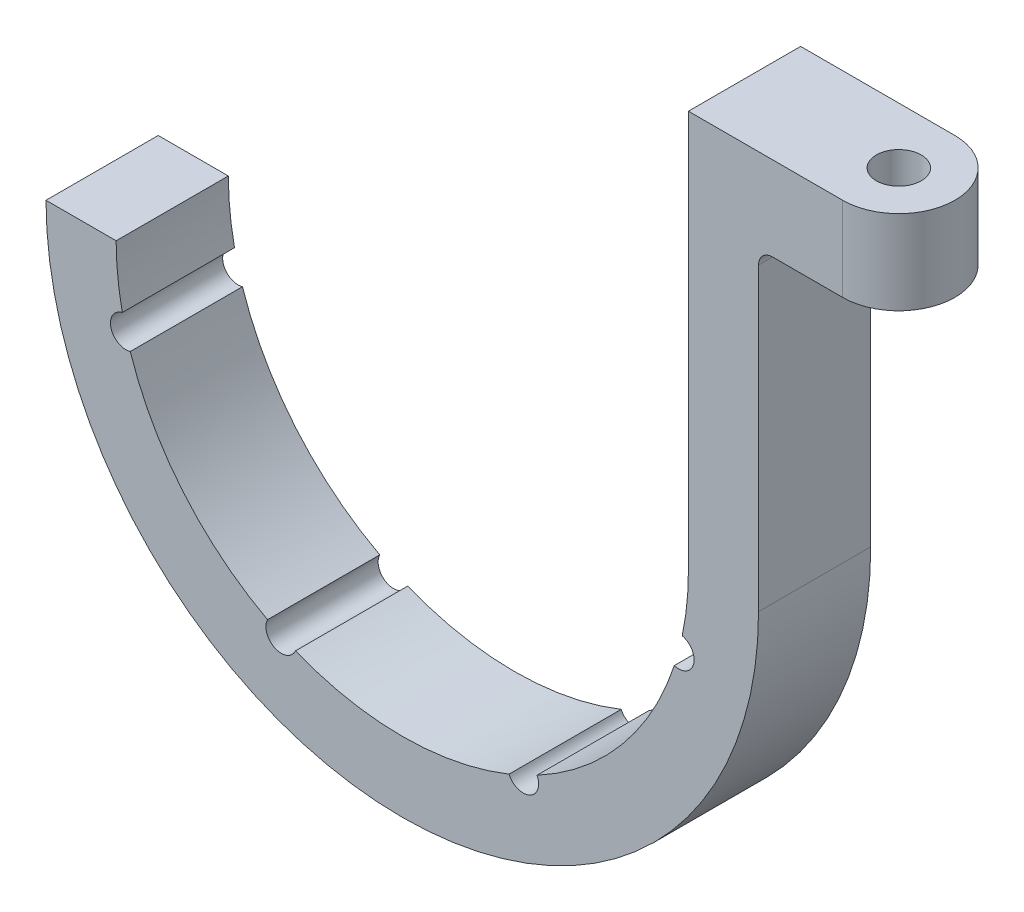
ISO-10303-21;
HEADER;
FILE_DESCRIPTION(('STEP AP214'),'2;1');
FILE_NAME('part.step','',(''),(''),'','','');
FILE_SCHEMA(('AUTOMOTIVE_DESIGN { 1 0 10303 214 1 1 1 1 }'));
ENDSEC;
DATA;
#1=APPLICATION_CONTEXT('core data for automotive mechanical design processes');
#2=APPLICATION_PROTOCOL_DEFINITION('international standard','automotive_design',2000,#1);
#3=PRODUCT_CONTEXT('',#1,'mechanical');
#4=PRODUCT('Part','Part','',(#3));
#5=PRODUCT_RELATED_PRODUCT_CATEGORY('part','',(#4));
#6=PRODUCT_DEFINITION_FORMATION('','',#4);
#7=PRODUCT_DEFINITION_CONTEXT('part definition',#1,'design');
#8=PRODUCT_DEFINITION('design','',#6,#7);
#9=PRODUCT_DEFINITION_SHAPE('','',#8);
#10=(LENGTH_UNIT() NAMED_UNIT(*) SI_UNIT(.MILLI.,.METRE.));
#11=(NAMED_UNIT(*) PLANE_ANGLE_UNIT() SI_UNIT($,.RADIAN.));
#12=(NAMED_UNIT(*) SI_UNIT($,.STERADIAN.) SOLID_ANGLE_UNIT());
#13=UNCERTAINTY_MEASURE_WITH_UNIT(LENGTH_MEASURE(1.E-05),#10,'distance_accuracy_value','');
#14=(GEOMETRIC_REPRESENTATION_CONTEXT(3) GLOBAL_UNCERTAINTY_ASSIGNED_CONTEXT((#13)) GLOBAL_UNIT_ASSIGNED_CONTEXT((#10,
#11,#12)) REPRESENTATION_CONTEXT('',''));
#15=CARTESIAN_POINT('',(0.,0.,0.));
#16=DIRECTION('',(0.,0.,1.));
#17=DIRECTION('',(1.,0.,0.));
#18=AXIS2_PLACEMENT_3D('',#15,#16,#17);
#19=CARTESIAN_POINT('',(0.,0.,8.));
#20=DIRECTION('',(0.,0.,-1.));
#21=DIRECTION('',(-1.,0.,0.));
#22=AXIS2_PLACEMENT_3D('',#19,#20,#21);
#23=CYLINDRICAL_SURFACE('',#22,20.4);
#24=CARTESIAN_POINT('',(0.,0.,0.));
#25=DIRECTION('',(0.,0.,1.));
#26=DIRECTION('',(1.,0.,0.));
#27=AXIS2_PLACEMENT_3D('',#24,#25,#26);
#28=CIRCLE('',#27,20.4);
#29=CARTESIAN_POINT('',(19.9608379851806,-4.21010058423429,0.));
#30=VERTEX_POINT('',#29);
#31=CARTESIAN_POINT('',(20.4,0.,0.));
#32=VERTEX_POINT('',#31);
#33=EDGE_CURVE('E196',#30,#32,#28,.T.);
#34=ORIENTED_EDGE('',*,*,#33,.F.);
#35=DIRECTION('',(0.,0.,-1.));
#36=VECTOR('',#35,1.);
#37=CARTESIAN_POINT('',(19.9608379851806,-4.21010058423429,8.));
#38=LINE('',#37,#36);
#39=CARTESIAN_POINT('',(19.9608379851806,-4.21010058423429,8.));
#40=VERTEX_POINT('',#39);
#41=EDGE_CURVE('E314',#40,#30,#38,.T.);
#42=ORIENTED_EDGE('',*,*,#41,.F.);
#43=CARTESIAN_POINT('',(0.,0.,8.));
#44=DIRECTION('',(0.,0.,1.));
#45=DIRECTION('',(1.,0.,0.));
#46=AXIS2_PLACEMENT_3D('',#43,#44,#45);
#47=CIRCLE('',#46,20.4);
#48=CARTESIAN_POINT('',(20.4,0.,8.));
#49=VERTEX_POINT('',#48);
#50=EDGE_CURVE('E198',#40,#49,#47,.T.);
#51=ORIENTED_EDGE('',*,*,#50,.T.);
#52=DIRECTION('',(0.,0.,-1.));
#53=VECTOR('',#52,1.);
#54=CARTESIAN_POINT('',(20.4,0.,8.));
#55=LINE('',#54,#53);
#56=EDGE_CURVE('E237',#49,#32,#55,.T.);
#57=ORIENTED_EDGE('',*,*,#56,.T.);
#58=EDGE_LOOP('',(#34,#42,#51,#57));
#59=FACE_BOUND('',#58,.T.);
#60=ADVANCED_FACE('F47',(#59),#23,.F.);
#61=CARTESIAN_POINT('',(19.704886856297,-5.27990852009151,8.));
#62=DIRECTION('',(0.,0.,-1.));
#63=DIRECTION('',(-1.,0.,0.));
#64=AXIS2_PLACEMENT_3D('',#61,#62,#63);
#65=CYLINDRICAL_SURFACE('',#64,1.1);
#66=CARTESIAN_POINT('',(19.704886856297,-5.27990852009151,0.));
#67=DIRECTION('',(0.,0.,1.));
#68=DIRECTION('',(1.,0.,0.));
#69=AXIS2_PLACEMENT_3D('',#66,#67,#68);
#70=CIRCLE('',#69,1.1);
#71=CARTESIAN_POINT('',(19.3916430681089,-6.3343649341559,0.));
#72=VERTEX_POINT('',#71);
#73=EDGE_CURVE('E241',#30,#72,#70,.F.);
#74=ORIENTED_EDGE('',*,*,#73,.T.);
#75=DIRECTION('',(0.,0.,-1.));
#76=VECTOR('',#75,1.);
#77=CARTESIAN_POINT('',(19.3916430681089,-6.3343649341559,8.));
#78=LINE('',#77,#76);
#79=CARTESIAN_POINT('',(19.3916430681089,-6.3343649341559,8.));
#80=VERTEX_POINT('',#79);
#81=EDGE_CURVE('E311',#80,#72,#78,.T.);
#82=ORIENTED_EDGE('',*,*,#81,.F.);
#83=CARTESIAN_POINT('',(19.704886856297,-5.27990852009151,8.));
#84=DIRECTION('',(0.,0.,1.));
#85=DIRECTION('',(1.,0.,0.));
#86=AXIS2_PLACEMENT_3D('',#83,#84,#85);
#87=CIRCLE('',#86,1.1);
#88=EDGE_CURVE('E202',#40,#80,#87,.F.);
#89=ORIENTED_EDGE('',*,*,#88,.F.);
#90=ORIENTED_EDGE('',*,*,#41,.T.);
#91=EDGE_LOOP('',(#74,#82,#89,#90));
#92=FACE_BOUND('',#91,.T.);
#93=ADVANCED_FACE('F352',(#92),#65,.F.);
#94=CARTESIAN_POINT('',(9.60545517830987,-17.9970895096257,0.));
#95=VERTEX_POINT('',#94);
#96=EDGE_CURVE('E243',#95,#72,#28,.T.);
#97=ORIENTED_EDGE('',*,*,#96,.F.);
#98=DIRECTION('',(0.,0.,-1.));
#99=VECTOR('',#98,1.);
#100=CARTESIAN_POINT('',(9.60545517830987,-17.9970895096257,8.));
#101=LINE('',#100,#99);
#102=CARTESIAN_POINT('',(9.60545517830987,-17.9970895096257,8.));
#103=VERTEX_POINT('',#102);
#104=EDGE_CURVE('E308',#103,#95,#101,.T.);
#105=ORIENTED_EDGE('',*,*,#104,.F.);
#106=EDGE_CURVE('E205',#103,#80,#47,.T.);
#107=ORIENTED_EDGE('',*,*,#106,.T.);
#108=ORIENTED_EDGE('',*,*,#81,.T.);
#109=EDGE_LOOP('',(#97,#105,#107,#108));
#110=FACE_BOUND('',#109,.T.);
#111=ADVANCED_FACE('F346',(#110),#23,.F.);
#112=CARTESIAN_POINT('',(8.62141253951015,-18.4886788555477,8.));
#113=DIRECTION('',(0.,0.,-1.));
#114=DIRECTION('',(-1.,0.,0.));
#115=AXIS2_PLACEMENT_3D('',#112,#113,#114);
#116=CYLINDRICAL_SURFACE('',#115,1.1);
#117=CARTESIAN_POINT('',(8.62141253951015,-18.4886788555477,0.));
#118=DIRECTION('',(0.,0.,1.));
#119=DIRECTION('',(1.,0.,0.));
#120=AXIS2_PLACEMENT_3D('',#117,#118,#119);
#121=CIRCLE('',#120,1.1);
#122=CARTESIAN_POINT('',(7.6123028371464,-18.9265117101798,0.));
#123=VERTEX_POINT('',#122);
#124=EDGE_CURVE('E247',#95,#123,#121,.F.);
#125=ORIENTED_EDGE('',*,*,#124,.T.);
#126=DIRECTION('',(0.,0.,-1.));
#127=VECTOR('',#126,1.);
#128=CARTESIAN_POINT('',(7.6123028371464,-18.9265117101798,8.));
#129=LINE('',#128,#127);
#130=CARTESIAN_POINT('',(7.6123028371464,-18.9265117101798,8.));
#131=VERTEX_POINT('',#130);
#132=EDGE_CURVE('E305',#131,#123,#129,.T.);
#133=ORIENTED_EDGE('',*,*,#132,.F.);
#134=CARTESIAN_POINT('',(8.62141253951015,-18.4886788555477,8.));
#135=DIRECTION('',(0.,0.,1.));
#136=DIRECTION('',(1.,0.,0.));
#137=AXIS2_PLACEMENT_3D('',#134,#135,#136);
#138=CIRCLE('',#137,1.1);
#139=EDGE_CURVE('E208',#103,#131,#138,.F.);
#140=ORIENTED_EDGE('',*,*,#139,.F.);
#141=ORIENTED_EDGE('',*,*,#104,.T.);
#142=EDGE_LOOP('',(#125,#133,#140,#141));
#143=FACE_BOUND('',#142,.T.);
#144=ADVANCED_FACE('F400',(#143),#116,.F.);
#145=CARTESIAN_POINT('',(-7.6123028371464,-18.9265117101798,0.));
#146=VERTEX_POINT('',#145);
#147=EDGE_CURVE('E251',#146,#123,#28,.T.);
#148=ORIENTED_EDGE('',*,*,#147,.F.);
#149=DIRECTION('',(0.,0.,-1.));
#150=VECTOR('',#149,1.);
#151=CARTESIAN_POINT('',(-7.6123028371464,-18.9265117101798,8.));
#152=LINE('',#151,#150);
#153=CARTESIAN_POINT('',(-7.6123028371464,-18.9265117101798,8.));
#154=VERTEX_POINT('',#153);
#155=EDGE_CURVE('E302',#154,#146,#152,.T.);
#156=ORIENTED_EDGE('',*,*,#155,.F.);
#157=EDGE_CURVE('E211',#154,#131,#47,.T.);
#158=ORIENTED_EDGE('',*,*,#157,.T.);
#159=ORIENTED_EDGE('',*,*,#132,.T.);
#160=EDGE_LOOP('',(#148,#156,#158,#159));
#161=FACE_BOUND('',#160,.T.);
#162=ADVANCED_FACE('F397',(#161),#23,.F.);
#163=CARTESIAN_POINT('',(-8.62141253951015,-18.4886788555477,8.));
#164=DIRECTION('',(0.,0.,-1.));
#165=DIRECTION('',(-1.,0.,0.));
#166=AXIS2_PLACEMENT_3D('',#163,#164,#165);
#167=CYLINDRICAL_SURFACE('',#166,1.1);
#168=CARTESIAN_POINT('',(-8.62141253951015,-18.4886788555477,0.));
#169=DIRECTION('',(0.,0.,1.));
#170=DIRECTION('',(1.,0.,0.));
#171=AXIS2_PLACEMENT_3D('',#168,#169,#170);
#172=CIRCLE('',#171,1.1);
#173=CARTESIAN_POINT('',(-9.60545517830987,-17.9970895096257,0.));
#174=VERTEX_POINT('',#173);
#175=EDGE_CURVE('E252',#174,#146,#172,.T.);
#176=ORIENTED_EDGE('',*,*,#175,.F.);
#177=DIRECTION('',(0.,0.,-1.));
#178=VECTOR('',#177,1.);
#179=CARTESIAN_POINT('',(-9.60545517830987,-17.9970895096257,8.));
#180=LINE('',#179,#178);
#181=CARTESIAN_POINT('',(-9.60545517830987,-17.9970895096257,8.));
#182=VERTEX_POINT('',#181);
#183=EDGE_CURVE('E299',#182,#174,#180,.T.);
#184=ORIENTED_EDGE('',*,*,#183,.F.);
#185=CARTESIAN_POINT('',(-8.62141253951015,-18.4886788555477,8.));
#186=DIRECTION('',(0.,0.,1.));
#187=DIRECTION('',(1.,0.,0.));
#188=AXIS2_PLACEMENT_3D('',#185,#186,#187);
#189=CIRCLE('',#188,1.1);
#190=EDGE_CURVE('E212',#182,#154,#189,.T.);
#191=ORIENTED_EDGE('',*,*,#190,.T.);
#192=ORIENTED_EDGE('',*,*,#155,.T.);
#193=EDGE_LOOP('',(#176,#184,#191,#192));
#194=FACE_BOUND('',#193,.T.);
#195=ADVANCED_FACE('F393',(#194),#167,.F.);
#196=CARTESIAN_POINT('',(-19.3916430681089,-6.3343649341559,0.));
#197=VERTEX_POINT('',#196);
#198=EDGE_CURVE('E256',#197,#174,#28,.T.);
#199=ORIENTED_EDGE('',*,*,#198,.F.);
#200=DIRECTION('',(0.,0.,-1.));
#201=VECTOR('',#200,1.);
#202=CARTESIAN_POINT('',(-19.3916430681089,-6.3343649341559,8.));
#203=LINE('',#202,#201);
#204=CARTESIAN_POINT('',(-19.3916430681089,-6.3343649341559,8.));
#205=VERTEX_POINT('',#204);
#206=EDGE_CURVE('E296',#205,#197,#203,.T.);
#207=ORIENTED_EDGE('',*,*,#206,.F.);
#208=EDGE_CURVE('E216',#205,#182,#47,.T.);
#209=ORIENTED_EDGE('',*,*,#208,.T.);
#210=ORIENTED_EDGE('',*,*,#183,.T.);
#211=EDGE_LOOP('',(#199,#207,#209,#210));
#212=FACE_BOUND('',#211,.T.);
#213=ADVANCED_FACE('F389',(#212),#23,.F.);
#214=CARTESIAN_POINT('',(-19.704886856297,-5.27990852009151,8.));
#215=DIRECTION('',(0.,0.,-1.));
#216=DIRECTION('',(-1.,0.,0.));
#217=AXIS2_PLACEMENT_3D('',#214,#215,#216);
#218=CYLINDRICAL_SURFACE('',#217,1.1);
#219=CARTESIAN_POINT('',(-19.704886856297,-5.27990852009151,0.));
#220=DIRECTION('',(0.,0.,1.));
#221=DIRECTION('',(1.,0.,0.));
#222=AXIS2_PLACEMENT_3D('',#219,#220,#221);
#223=CIRCLE('',#222,1.1);
#224=CARTESIAN_POINT('',(-19.9608379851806,-4.21010058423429,0.));
#225=VERTEX_POINT('',#224);
#226=EDGE_CURVE('E257',#225,#197,#223,.T.);
#227=ORIENTED_EDGE('',*,*,#226,.F.);
#228=DIRECTION('',(0.,0.,-1.));
#229=VECTOR('',#228,1.);
#230=CARTESIAN_POINT('',(-19.9608379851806,-4.21010058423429,8.));
#231=LINE('',#230,#229);
#232=CARTESIAN_POINT('',(-19.9608379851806,-4.21010058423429,8.));
#233=VERTEX_POINT('',#232);
#234=EDGE_CURVE('E293',#233,#225,#231,.T.);
#235=ORIENTED_EDGE('',*,*,#234,.F.);
#236=CARTESIAN_POINT('',(-19.704886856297,-5.27990852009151,8.));
#237=DIRECTION('',(0.,0.,1.));
#238=DIRECTION('',(1.,0.,0.));
#239=AXIS2_PLACEMENT_3D('',#236,#237,#238);
#240=CIRCLE('',#239,1.1);
#241=EDGE_CURVE('E217',#233,#205,#240,.T.);
#242=ORIENTED_EDGE('',*,*,#241,.T.);
#243=ORIENTED_EDGE('',*,*,#206,.T.);
#244=EDGE_LOOP('',(#227,#235,#242,#243));
#245=FACE_BOUND('',#244,.T.);
#246=ADVANCED_FACE('F385',(#245),#218,.F.);
#247=CARTESIAN_POINT('',(-20.4,0.,0.));
#248=VERTEX_POINT('',#247);
#249=EDGE_CURVE('E242',#248,#225,#28,.T.);
#250=ORIENTED_EDGE('',*,*,#249,.F.);
#251=DIRECTION('',(0.,0.,-1.));
#252=VECTOR('',#251,1.);
#253=CARTESIAN_POINT('',(-20.4,0.,8.));
#254=LINE('',#253,#252);
#255=CARTESIAN_POINT('',(-20.4,0.,8.));
#256=VERTEX_POINT('',#255);
#257=EDGE_CURVE('E290',#256,#248,#254,.T.);
#258=ORIENTED_EDGE('',*,*,#257,.F.);
#259=EDGE_CURVE('E204',#256,#233,#47,.T.);
#260=ORIENTED_EDGE('',*,*,#259,.T.);
#261=ORIENTED_EDGE('',*,*,#234,.T.);
#262=EDGE_LOOP('',(#250,#258,#260,#261));
#263=FACE_BOUND('',#262,.T.);
#264=ADVANCED_FACE('F381',(#263),#23,.F.);
#265=CARTESIAN_POINT('',(0.,0.,8.));
#266=DIRECTION('',(0.,-1.,0.));
#267=DIRECTION('',(0.,0.,-1.));
#268=AXIS2_PLACEMENT_3D('',#265,#266,#267);
#269=PLANE('',#268);
#270=DIRECTION('',(-1.,0.,0.));
#271=VECTOR('',#270,1.);
#272=CARTESIAN_POINT('',(0.,0.,0.));
#273=LINE('',#272,#271);
#274=CARTESIAN_POINT('',(-25.4,0.,0.));
#275=VERTEX_POINT('',#274);
#276=EDGE_CURVE('E261',#248,#275,#273,.T.);
#277=ORIENTED_EDGE('',*,*,#276,.T.);
#278=DIRECTION('',(0.,0.,-1.));
#279=VECTOR('',#278,1.);
#280=CARTESIAN_POINT('',(-25.4,0.,8.));
#281=LINE('',#280,#279);
#282=CARTESIAN_POINT('',(-25.4,0.,8.));
#283=VERTEX_POINT('',#282);
#284=EDGE_CURVE('E286',#283,#275,#281,.T.);
#285=ORIENTED_EDGE('',*,*,#284,.F.);
#286=DIRECTION('',(-1.,0.,0.));
#287=VECTOR('',#286,1.);
#288=CARTESIAN_POINT('',(0.,0.,8.));
#289=LINE('',#288,#287);
#290=EDGE_CURVE('E221',#256,#283,#289,.T.);
#291=ORIENTED_EDGE('',*,*,#290,.F.);
#292=ORIENTED_EDGE('',*,*,#257,.T.);
#293=EDGE_LOOP('',(#277,#285,#291,#292));
#294=FACE_BOUND('',#293,.T.);
#295=ADVANCED_FACE('F416',(#294),#269,.F.);
#296=CARTESIAN_POINT('',(0.,0.,8.));
#297=DIRECTION('',(0.,0.,-1.));
#298=DIRECTION('',(-1.,0.,0.));
#299=AXIS2_PLACEMENT_3D('',#296,#297,#298);
#300=CYLINDRICAL_SURFACE('',#299,25.4);
#301=CARTESIAN_POINT('',(0.,0.,0.));
#302=DIRECTION('',(0.,0.,1.));
#303=DIRECTION('',(1.,0.,0.));
#304=AXIS2_PLACEMENT_3D('',#301,#302,#303);
#305=CIRCLE('',#304,25.4);
#306=CARTESIAN_POINT('',(25.4,0.,0.));
#307=VERTEX_POINT('',#306);
#308=EDGE_CURVE('E264',#275,#307,#305,.T.);
#309=ORIENTED_EDGE('',*,*,#308,.T.);
#310=DIRECTION('',(0.,0.,-1.));
#311=VECTOR('',#310,1.);
#312=CARTESIAN_POINT('',(25.4,0.,8.));
#313=LINE('',#312,#311);
#314=CARTESIAN_POINT('',(25.4,0.,8.));
#315=VERTEX_POINT('',#314);
#316=EDGE_CURVE('E282',#315,#307,#313,.T.);
#317=ORIENTED_EDGE('',*,*,#316,.F.);
#318=CARTESIAN_POINT('',(0.,0.,8.));
#319=DIRECTION('',(0.,0.,1.));
#320=DIRECTION('',(1.,0.,0.));
#321=AXIS2_PLACEMENT_3D('',#318,#319,#320);
#322=CIRCLE('',#321,25.4);
#323=EDGE_CURVE('E224',#283,#315,#322,.T.);
#324=ORIENTED_EDGE('',*,*,#323,.F.);
#325=ORIENTED_EDGE('',*,*,#284,.T.);
#326=EDGE_LOOP('',(#309,#317,#324,#325));
#327=FACE_BOUND('',#326,.T.);
#328=ADVANCED_FACE('F375',(#327),#300,.T.);
#329=CARTESIAN_POINT('',(25.4,0.,8.));
#330=DIRECTION('',(-1.,0.,0.));
#331=DIRECTION('',(0.,0.,1.));
#332=AXIS2_PLACEMENT_3D('',#329,#330,#331);
#333=PLANE('',#332);
#334=DIRECTION('',(0.,1.,0.));
#335=VECTOR('',#334,1.);
#336=CARTESIAN_POINT('',(25.4,0.,0.));
#337=LINE('',#336,#335);
#338=CARTESIAN_POINT('',(25.4,21.4,0.));
#339=VERTEX_POINT('',#338);
#340=EDGE_CURVE('E267',#307,#339,#337,.T.);
#341=ORIENTED_EDGE('',*,*,#340,.T.);
#342=DIRECTION('',(0.,0.,1.));
#343=VECTOR('',#342,1.);
#344=CARTESIAN_POINT('',(25.4,21.4,8.));
#345=LINE('',#344,#343);
#346=CARTESIAN_POINT('',(25.4,21.4,8.));
#347=VERTEX_POINT('',#346);
#348=EDGE_CURVE('E317',#339,#347,#345,.T.);
#349=ORIENTED_EDGE('',*,*,#348,.T.);
#350=DIRECTION('',(0.,1.,0.));
#351=VECTOR('',#350,1.);
#352=CARTESIAN_POINT('',(25.4,0.,8.));
#353=LINE('',#352,#351);
#354=EDGE_CURVE('E227',#315,#347,#353,.T.);
#355=ORIENTED_EDGE('',*,*,#354,.F.);
#356=ORIENTED_EDGE('',*,*,#316,.T.);
#357=EDGE_LOOP('',(#341,#349,#355,#356));
#358=FACE_BOUND('',#357,.T.);
#359=ADVANCED_FACE('F368',(#358),#333,.F.);
#360=CARTESIAN_POINT('',(0.,28.4,8.));
#361=DIRECTION('',(0.,1.,0.));
#362=DIRECTION('',(0.,0.,1.));
#363=AXIS2_PLACEMENT_3D('',#360,#361,#362);
#364=PLANE('',#363);
#365=DIRECTION('',(1.,0.,0.));
#366=VECTOR('',#365,1.);
#367=CARTESIAN_POINT('',(0.,28.4,0.));
#368=LINE('',#367,#366);
#369=CARTESIAN_POINT('',(20.4,28.4,0.));
#370=VERTEX_POINT('',#369);
#371=CARTESIAN_POINT('',(31.4,28.4,0.));
#372=VERTEX_POINT('',#371);
#373=EDGE_CURVE('E271',#370,#372,#368,.T.);
#374=ORIENTED_EDGE('',*,*,#373,.F.);
#375=DIRECTION('',(0.,0.,-1.));
#376=VECTOR('',#375,1.);
#377=CARTESIAN_POINT('',(20.4,28.4,8.));
#378=LINE('',#377,#376);
#379=CARTESIAN_POINT('',(20.4,28.4,8.));
#380=VERTEX_POINT('',#379);
#381=EDGE_CURVE('E279',#380,#370,#378,.T.);
#382=ORIENTED_EDGE('',*,*,#381,.F.);
#383=DIRECTION('',(1.,0.,0.));
#384=VECTOR('',#383,1.);
#385=CARTESIAN_POINT('',(0.,28.4,8.));
#386=LINE('',#385,#384);
#387=CARTESIAN_POINT('',(31.4,28.4,8.));
#388=VERTEX_POINT('',#387);
#389=EDGE_CURVE('E230',#380,#388,#386,.T.);
#390=ORIENTED_EDGE('',*,*,#389,.T.);
#391=CARTESIAN_POINT('',(31.4,28.4,4.));
#392=DIRECTION('',(0.,1.,0.));
#393=DIRECTION('',(0.,0.,-1.));
#394=AXIS2_PLACEMENT_3D('',#391,#392,#393);
#395=CIRCLE('',#394,4.);
#396=EDGE_CURVE('E174',#388,#372,#395,.T.);
#397=ORIENTED_EDGE('',*,*,#396,.T.);
#398=EDGE_LOOP('',(#374,#382,#390,#397));
#399=FACE_BOUND('',#398,.T.);
#400=CARTESIAN_POINT('',(31.4,28.4,4.));
#401=DIRECTION('',(0.,1.,0.));
#402=DIRECTION('',(0.,0.,1.));
#403=AXIS2_PLACEMENT_3D('',#400,#401,#402);
#404=CIRCLE('',#403,1.60000000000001);
#405=CARTESIAN_POINT('',(31.4,28.4,5.6));
#406=VERTEX_POINT('',#405);
#407=EDGE_CURVE('E578',#406,#406,#404,.T.);
#408=ORIENTED_EDGE('',*,*,#407,.F.);
#409=EDGE_LOOP('',(#408));
#410=FACE_BOUND('',#409,.T.);
#411=ADVANCED_FACE('F360',(#399,#410),#364,.T.);
#412=CARTESIAN_POINT('',(20.4,0.,8.));
#413=DIRECTION('',(-1.,0.,0.));
#414=DIRECTION('',(0.,-1.,0.));
#415=AXIS2_PLACEMENT_3D('',#412,#413,#414);
#416=PLANE('',#415);
#417=DIRECTION('',(0.,1.,0.));
#418=VECTOR('',#417,1.);
#419=CARTESIAN_POINT('',(20.4,0.,0.));
#420=LINE('',#419,#418);
#421=EDGE_CURVE('E203',#32,#370,#420,.T.);
#422=ORIENTED_EDGE('',*,*,#421,.F.);
#423=ORIENTED_EDGE('',*,*,#56,.F.);
#424=DIRECTION('',(0.,1.,0.));
#425=VECTOR('',#424,1.);
#426=CARTESIAN_POINT('',(20.4,0.,8.));
#427=LINE('',#426,#425);
#428=EDGE_CURVE('E233',#49,#380,#427,.T.);
#429=ORIENTED_EDGE('',*,*,#428,.T.);
#430=ORIENTED_EDGE('',*,*,#381,.T.);
#431=EDGE_LOOP('',(#422,#423,#429,#430));
#432=FACE_BOUND('',#431,.T.);
#433=ADVANCED_FACE('F357',(#432),#416,.T.);
#434=CARTESIAN_POINT('',(0.,0.,8.));
#435=DIRECTION('',(0.,0.,1.));
#436=DIRECTION('',(1.,0.,0.));
#437=AXIS2_PLACEMENT_3D('',#434,#435,#436);
#438=PLANE('',#437);
#439=ORIENTED_EDGE('',*,*,#50,.F.);
#440=ORIENTED_EDGE('',*,*,#88,.T.);
#441=ORIENTED_EDGE('',*,*,#106,.F.);
#442=ORIENTED_EDGE('',*,*,#139,.T.);
#443=ORIENTED_EDGE('',*,*,#157,.F.);
#444=ORIENTED_EDGE('',*,*,#190,.F.);
#445=ORIENTED_EDGE('',*,*,#208,.F.);
#446=ORIENTED_EDGE('',*,*,#241,.F.);
#447=ORIENTED_EDGE('',*,*,#259,.F.);
#448=ORIENTED_EDGE('',*,*,#290,.T.);
#449=ORIENTED_EDGE('',*,*,#323,.T.);
#450=ORIENTED_EDGE('',*,*,#354,.T.);
#451=CARTESIAN_POINT('',(26.4,21.4,8.));
#452=DIRECTION('',(0.,0.,1.));
#453=DIRECTION('',(1.,0.,0.));
#454=AXIS2_PLACEMENT_3D('',#451,#452,#453);
#455=CIRCLE('',#454,1.);
#456=CARTESIAN_POINT('',(26.4,22.4,8.));
#457=VERTEX_POINT('',#456);
#458=EDGE_CURVE('E56',#347,#457,#455,.F.);
#459=ORIENTED_EDGE('',*,*,#458,.T.);
#460=DIRECTION('',(1.,0.,0.));
#461=VECTOR('',#460,1.);
#462=CARTESIAN_POINT('',(31.4,22.4,8.));
#463=LINE('',#462,#461);
#464=CARTESIAN_POINT('',(31.4,22.4,8.));
#465=VERTEX_POINT('',#464);
#466=EDGE_CURVE('E164',#457,#465,#463,.T.);
#467=ORIENTED_EDGE('',*,*,#466,.T.);
#468=DIRECTION('',(0.,1.,0.));
#469=VECTOR('',#468,1.);
#470=CARTESIAN_POINT('',(31.4,22.4,8.));
#471=LINE('',#470,#469);
#472=EDGE_CURVE('E169',#465,#388,#471,.T.);
#473=ORIENTED_EDGE('',*,*,#472,.T.);
#474=ORIENTED_EDGE('',*,*,#389,.F.);
#475=ORIENTED_EDGE('',*,*,#428,.F.);
#476=EDGE_LOOP('',(#439,#440,#441,#442,#443,#444,#445,#446,#447,#448,#449,#450,#459,#467,#473,
#474,#475));
#477=FACE_BOUND('',#476,.T.);
#478=ADVANCED_FACE('F167',(#477),#438,.T.);
#479=CARTESIAN_POINT('',(0.,0.,0.));
#480=DIRECTION('',(0.,0.,1.));
#481=DIRECTION('',(1.,0.,0.));
#482=AXIS2_PLACEMENT_3D('',#479,#480,#481);
#483=PLANE('',#482);
#484=ORIENTED_EDGE('',*,*,#33,.T.);
#485=ORIENTED_EDGE('',*,*,#421,.T.);
#486=ORIENTED_EDGE('',*,*,#373,.T.);
#487=DIRECTION('',(0.,1.,0.));
#488=VECTOR('',#487,1.);
#489=CARTESIAN_POINT('',(31.4,22.4,0.));
#490=LINE('',#489,#488);
#491=CARTESIAN_POINT('',(31.4,22.4,0.));
#492=VERTEX_POINT('',#491);
#493=EDGE_CURVE('E182',#492,#372,#490,.T.);
#494=ORIENTED_EDGE('',*,*,#493,.F.);
#495=DIRECTION('',(-1.,0.,0.));
#496=VECTOR('',#495,1.);
#497=CARTESIAN_POINT('',(25.4,22.4,0.));
#498=LINE('',#497,#496);
#499=CARTESIAN_POINT('',(26.4,22.4,0.));
#500=VERTEX_POINT('',#499);
#501=EDGE_CURVE('E183',#492,#500,#498,.T.);
#502=ORIENTED_EDGE('',*,*,#501,.T.);
#503=CARTESIAN_POINT('',(26.4,21.4,0.));
#504=DIRECTION('',(0.,0.,1.));
#505=DIRECTION('',(1.,0.,0.));
#506=AXIS2_PLACEMENT_3D('',#503,#504,#505);
#507=CIRCLE('',#506,1.);
#508=EDGE_CURVE('E11',#500,#339,#507,.T.);
#509=ORIENTED_EDGE('',*,*,#508,.T.);
#510=ORIENTED_EDGE('',*,*,#340,.F.);
#511=ORIENTED_EDGE('',*,*,#308,.F.);
#512=ORIENTED_EDGE('',*,*,#276,.F.);
#513=ORIENTED_EDGE('',*,*,#249,.T.);
#514=ORIENTED_EDGE('',*,*,#226,.T.);
#515=ORIENTED_EDGE('',*,*,#198,.T.);
#516=ORIENTED_EDGE('',*,*,#175,.T.);
#517=ORIENTED_EDGE('',*,*,#147,.T.);
#518=ORIENTED_EDGE('',*,*,#124,.F.);
#519=ORIENTED_EDGE('',*,*,#96,.T.);
#520=ORIENTED_EDGE('',*,*,#73,.F.);
#521=EDGE_LOOP('',(#484,#485,#486,#494,#502,#509,#510,#511,#512,#513,#514,#515,#516,#517,#518,
#519,#520));
#522=FACE_BOUND('',#521,.T.);
#523=ADVANCED_FACE('F343',(#522),#483,.F.);
#524=CARTESIAN_POINT('',(31.4,22.4,4.));
#525=DIRECTION('',(0.,1.,0.));
#526=DIRECTION('',(0.,0.,1.));
#527=AXIS2_PLACEMENT_3D('',#524,#525,#526);
#528=CYLINDRICAL_SURFACE('',#527,4.);
#529=ORIENTED_EDGE('',*,*,#396,.F.);
#530=ORIENTED_EDGE('',*,*,#472,.F.);
#531=CARTESIAN_POINT('',(31.4,22.4,4.));
#532=DIRECTION('',(0.,1.,0.));
#533=DIRECTION('',(0.,0.,-1.));
#534=AXIS2_PLACEMENT_3D('',#531,#532,#533);
#535=CIRCLE('',#534,4.);
#536=EDGE_CURVE('E173',#465,#492,#535,.T.);
#537=ORIENTED_EDGE('',*,*,#536,.T.);
#538=ORIENTED_EDGE('',*,*,#493,.T.);
#539=EDGE_LOOP('',(#529,#530,#537,#538));
#540=FACE_BOUND('',#539,.T.);
#541=ADVANCED_FACE('F178',(#540),#528,.T.);
#542=CARTESIAN_POINT('',(31.4,22.4,4.));
#543=DIRECTION('',(0.,-1.,0.));
#544=DIRECTION('',(0.,0.,-1.));
#545=AXIS2_PLACEMENT_3D('',#542,#543,#544);
#546=PLANE('',#545);
#547=CARTESIAN_POINT('',(31.4,22.4,4.));
#548=DIRECTION('',(0.,1.,0.));
#549=DIRECTION('',(0.,0.,1.));
#550=AXIS2_PLACEMENT_3D('',#547,#548,#549);
#551=CIRCLE('',#550,1.60000000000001);
#552=CARTESIAN_POINT('',(31.4,22.4,5.6));
#553=VERTEX_POINT('',#552);
#554=EDGE_CURVE('E194',#553,#553,#551,.T.);
#555=ORIENTED_EDGE('',*,*,#554,.T.);
#556=EDGE_LOOP('',(#555));
#557=FACE_BOUND('',#556,.T.);
#558=ORIENTED_EDGE('',*,*,#466,.F.);
#559=DIRECTION('',(0.,0.,1.));
#560=VECTOR('',#559,1.);
#561=CARTESIAN_POINT('',(26.4,22.4,4.));
#562=LINE('',#561,#560);
#563=EDGE_CURVE('E63',#457,#500,#562,.F.);
#564=ORIENTED_EDGE('',*,*,#563,.T.);
#565=ORIENTED_EDGE('',*,*,#501,.F.);
#566=ORIENTED_EDGE('',*,*,#536,.F.);
#567=EDGE_LOOP('',(#558,#564,#565,#566));
#568=FACE_BOUND('',#567,.T.);
#569=ADVANCED_FACE('F185',(#557,#568),#546,.T.);
#570=CARTESIAN_POINT('',(31.4,22.4,4.));
#571=DIRECTION('',(0.,1.,0.));
#572=DIRECTION('',(0.,0.,1.));
#573=AXIS2_PLACEMENT_3D('',#570,#571,#572);
#574=CYLINDRICAL_SURFACE('',#573,1.60000000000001);
#575=ORIENTED_EDGE('',*,*,#554,.F.);
#576=EDGE_LOOP('',(#575));
#577=FACE_BOUND('',#576,.T.);
#578=ORIENTED_EDGE('',*,*,#407,.T.);
#579=EDGE_LOOP('',(#578));
#580=FACE_BOUND('',#579,.T.);
#581=ADVANCED_FACE('F533',(#577,#580),#574,.F.);
#582=CARTESIAN_POINT('',(26.4,21.4,8.));
#583=DIRECTION('',(0.,0.,1.));
#584=DIRECTION('',(1.,0.,0.));
#585=AXIS2_PLACEMENT_3D('',#582,#583,#584);
#586=CYLINDRICAL_SURFACE('',#585,1.);
#587=ORIENTED_EDGE('',*,*,#508,.F.);
#588=ORIENTED_EDGE('',*,*,#563,.F.);
#589=ORIENTED_EDGE('',*,*,#458,.F.);
#590=ORIENTED_EDGE('',*,*,#348,.F.);
#591=EDGE_LOOP('',(#587,#588,#589,#590));
#592=FACE_BOUND('',#591,.T.);
#593=ADVANCED_FACE('F49',(#592),#586,.F.);
#594=CLOSED_SHELL('',(#60,#93,#111,#144,#162,#195,#213,#246,#264,#295,#328,#359,#411,#433,#478,
#523,#541,#569,#581,#593));
#595=MANIFOLD_SOLID_BREP('B2',#594);
#596=ADVANCED_BREP_SHAPE_REPRESENTATION('',(#18,#595),#14);
#597=SHAPE_DEFINITION_REPRESENTATION(#9,#596);
ENDSEC;
END-ISO-10303-21;
